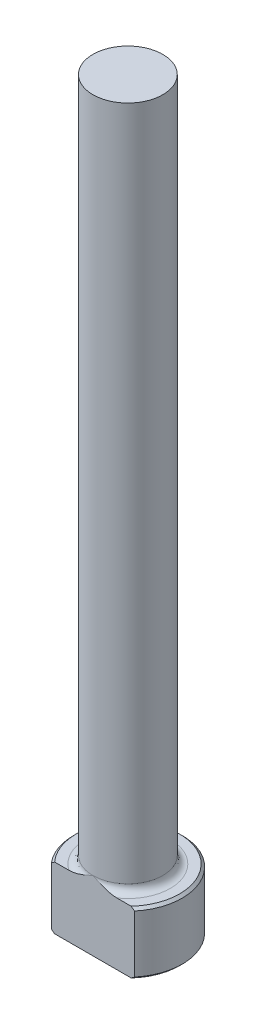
ISO-10303-21;
HEADER;
FILE_DESCRIPTION(('STEP AP214'),'2;1');
FILE_NAME('part.step','',(''),(''),'','','');
FILE_SCHEMA(('AUTOMOTIVE_DESIGN { 1 0 10303 214 1 1 1 1 }'));
ENDSEC;
DATA;
#1=APPLICATION_CONTEXT('core data for automotive mechanical design processes');
#2=APPLICATION_PROTOCOL_DEFINITION('international standard','automotive_design',2000,#1);
#3=PRODUCT_CONTEXT('',#1,'mechanical');
#4=PRODUCT('Part','Part','',(#3));
#5=PRODUCT_RELATED_PRODUCT_CATEGORY('part','',(#4));
#6=PRODUCT_DEFINITION_FORMATION('','',#4);
#7=PRODUCT_DEFINITION_CONTEXT('part definition',#1,'design');
#8=PRODUCT_DEFINITION('design','',#6,#7);
#9=PRODUCT_DEFINITION_SHAPE('','',#8);
#10=(LENGTH_UNIT() NAMED_UNIT(*) SI_UNIT(.MILLI.,.METRE.));
#11=(NAMED_UNIT(*) PLANE_ANGLE_UNIT() SI_UNIT($,.RADIAN.));
#12=(NAMED_UNIT(*) SI_UNIT($,.STERADIAN.) SOLID_ANGLE_UNIT());
#13=UNCERTAINTY_MEASURE_WITH_UNIT(LENGTH_MEASURE(1.E-05),#10,'distance_accuracy_value','');
#14=(GEOMETRIC_REPRESENTATION_CONTEXT(3) GLOBAL_UNCERTAINTY_ASSIGNED_CONTEXT((#13)) GLOBAL_UNIT_ASSIGNED_CONTEXT((#10,
#11,#12)) REPRESENTATION_CONTEXT('',''));
#15=CARTESIAN_POINT('',(0.,0.,0.));
#16=DIRECTION('',(0.,0.,1.));
#17=DIRECTION('',(1.,0.,0.));
#18=AXIS2_PLACEMENT_3D('',#15,#16,#17);
#19=CARTESIAN_POINT('',(0.,0.,0.));
#20=DIRECTION('',(0.,-1.,0.));
#21=DIRECTION('',(0.,0.,-1.));
#22=AXIS2_PLACEMENT_3D('',#19,#20,#21);
#23=PLANE('',#22);
#24=CARTESIAN_POINT('',(0.,0.,0.));
#25=DIRECTION('',(0.,-1.,0.));
#26=DIRECTION('',(0.,0.,-1.));
#27=AXIS2_PLACEMENT_3D('',#24,#25,#26);
#28=CIRCLE('',#27,5.29589999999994);
#29=CARTESIAN_POINT('',(-3.91060119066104,0.,3.57123999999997));
#30=VERTEX_POINT('',#29);
#31=CARTESIAN_POINT('',(3.91060119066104,0.,3.57123999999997));
#32=VERTEX_POINT('',#31);
#33=EDGE_CURVE('E98',#30,#32,#28,.T.);
#34=ORIENTED_EDGE('',*,*,#33,.T.);
#35=DIRECTION('',(-1.,0.,0.));
#36=VECTOR('',#35,1.);
#37=CARTESIAN_POINT('',(-4.24825080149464,0.,3.57123999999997));
#38=LINE('',#37,#36);
#39=EDGE_CURVE('E83',#32,#30,#38,.T.);
#40=ORIENTED_EDGE('',*,*,#39,.T.);
#41=EDGE_LOOP('',(#34,#40));
#42=FACE_BOUND('',#41,.T.);
#43=ADVANCED_FACE('F32',(#42),#23,.T.);
#44=CARTESIAN_POINT('',(0.,259.958771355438,0.));
#45=DIRECTION('',(0.,1.,0.));
#46=DIRECTION('',(0.,0.,1.));
#47=AXIS2_PLACEMENT_3D('',#44,#45,#46);
#48=CYLINDRICAL_SURFACE('',#47,5.54989999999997);
#49=CARTESIAN_POINT('',(0.,6.09599999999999,0.));
#50=DIRECTION('',(0.,1.,0.));
#51=DIRECTION('',(0.,0.,1.));
#52=AXIS2_PLACEMENT_3D('',#49,#50,#51);
#53=CIRCLE('',#52,5.54989999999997);
#54=CARTESIAN_POINT('',(-4.24825080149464,6.09599999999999,3.57123999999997));
#55=VERTEX_POINT('',#54);
#56=CARTESIAN_POINT('',(4.24825080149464,6.09599999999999,3.57123999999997));
#57=VERTEX_POINT('',#56);
#58=EDGE_CURVE('E104',#55,#57,#53,.F.);
#59=ORIENTED_EDGE('',*,*,#58,.T.);
#60=DIRECTION('',(0.,-1.,0.));
#61=VECTOR('',#60,1.);
#62=CARTESIAN_POINT('',(4.24825080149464,76.2,3.57123999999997));
#63=LINE('',#62,#61);
#64=CARTESIAN_POINT('',(4.24825080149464,0.254000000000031,3.57123999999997));
#65=VERTEX_POINT('',#64);
#66=EDGE_CURVE('E183',#57,#65,#63,.T.);
#67=ORIENTED_EDGE('',*,*,#66,.T.);
#68=CARTESIAN_POINT('',(0.,0.254000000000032,0.));
#69=DIRECTION('',(0.,-1.,0.));
#70=DIRECTION('',(0.,0.,-1.));
#71=AXIS2_PLACEMENT_3D('',#68,#69,#70);
#72=CIRCLE('',#71,5.54989999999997);
#73=CARTESIAN_POINT('',(-4.24825080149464,0.254000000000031,3.57123999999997));
#74=VERTEX_POINT('',#73);
#75=EDGE_CURVE('E100',#65,#74,#72,.F.);
#76=ORIENTED_EDGE('',*,*,#75,.T.);
#77=DIRECTION('',(0.,-1.,0.));
#78=VECTOR('',#77,1.);
#79=CARTESIAN_POINT('',(-4.24825080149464,76.2,3.57123999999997));
#80=LINE('',#79,#78);
#81=EDGE_CURVE('E93',#55,#74,#80,.T.);
#82=ORIENTED_EDGE('',*,*,#81,.F.);
#83=EDGE_LOOP('',(#59,#67,#76,#82));
#84=FACE_BOUND('',#83,.T.);
#85=ADVANCED_FACE('F158',(#84),#48,.T.);
#86=CARTESIAN_POINT('',(-5.54989999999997,6.35,0.));
#87=DIRECTION('',(0.,1.,0.));
#88=DIRECTION('',(0.,0.,1.));
#89=AXIS2_PLACEMENT_3D('',#86,#87,#88);
#90=PLANE('',#89);
#91=CARTESIAN_POINT('',(0.,6.35,0.));
#92=DIRECTION('',(0.,1.,0.));
#93=DIRECTION('',(0.,0.,1.));
#94=AXIS2_PLACEMENT_3D('',#91,#92,#93);
#95=CIRCLE('',#94,5.2959);
#96=CARTESIAN_POINT('',(3.91060119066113,6.35,3.57123999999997));
#97=VERTEX_POINT('',#96);
#98=CARTESIAN_POINT('',(-3.91060119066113,6.35,3.57123999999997));
#99=VERTEX_POINT('',#98);
#100=EDGE_CURVE('E178',#97,#99,#95,.T.);
#101=ORIENTED_EDGE('',*,*,#100,.T.);
#102=DIRECTION('',(1.,0.,0.));
#103=VECTOR('',#102,1.);
#104=CARTESIAN_POINT('',(-5.54989999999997,6.35,3.57123999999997));
#105=LINE('',#104,#103);
#106=CARTESIAN_POINT('',(-2.4542236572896,6.35000000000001,3.57123999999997));
#107=VERTEX_POINT('',#106);
#108=EDGE_CURVE('E57',#99,#107,#105,.T.);
#109=ORIENTED_EDGE('',*,*,#108,.T.);
#110=CARTESIAN_POINT('',(0.,6.35,0.));
#111=DIRECTION('',(0.,1.,0.));
#112=DIRECTION('',(0.,0.,1.));
#113=AXIS2_PLACEMENT_3D('',#110,#111,#112);
#114=CIRCLE('',#113,4.33323999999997);
#115=CARTESIAN_POINT('',(2.45422365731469,6.35000000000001,3.57123999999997));
#116=VERTEX_POINT('',#115);
#117=EDGE_CURVE('E107',#107,#116,#114,.F.);
#118=ORIENTED_EDGE('',*,*,#117,.T.);
#119=EDGE_CURVE('E136',#116,#97,#105,.T.);
#120=ORIENTED_EDGE('',*,*,#119,.T.);
#121=EDGE_LOOP('',(#101,#109,#118,#120));
#122=FACE_BOUND('',#121,.T.);
#123=ADVANCED_FACE('F147',(#122),#90,.T.);
#124=CARTESIAN_POINT('',(0.,6.35000000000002,0.));
#125=DIRECTION('',(0.,-1.,0.));
#126=DIRECTION('',(0.,0.,-1.));
#127=AXIS2_PLACEMENT_3D('',#124,#125,#126);
#128=CONICAL_SURFACE('',#127,5.29589999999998,0.785398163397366);
#129=ORIENTED_EDGE('',*,*,#58,.F.);
#130=CARTESIAN_POINT('',(-9.34862922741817,1.63837165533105,3.57123999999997));
#131=CARTESIAN_POINT('',(-9.20449095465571,1.7730174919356,3.57123999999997));
#132=CARTESIAN_POINT('',(-9.06015748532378,1.90745428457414,3.57123999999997));
#133=CARTESIAN_POINT('',(-8.77103871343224,2.17584295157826,3.57123999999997));
#134=CARTESIAN_POINT('',(-8.62625340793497,2.30979482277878,3.57123999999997));
#135=CARTESIAN_POINT('',(-8.19106245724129,2.71088279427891,3.57123999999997));
#136=CARTESIAN_POINT('',(-7.89988923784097,2.97718811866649,3.57123999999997));
#137=CARTESIAN_POINT('',(-7.31266273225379,3.50875703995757,3.57123999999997));
#138=CARTESIAN_POINT('',(-7.0165892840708,3.77399839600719,3.57123999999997));
#139=CARTESIAN_POINT('',(-6.42070514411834,4.30018345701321,3.57123999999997));
#140=CARTESIAN_POINT('',(-6.12089498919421,4.56112776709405,3.57123999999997));
#141=CARTESIAN_POINT('',(-5.57379517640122,5.02739327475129,3.57123999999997));
#142=CARTESIAN_POINT('',(-5.32743465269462,5.23380250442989,3.57123999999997));
#143=CARTESIAN_POINT('',(-4.82983105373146,5.64086952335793,3.57123999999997));
#144=CARTESIAN_POINT('',(-4.57858641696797,5.84152542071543,3.57123999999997));
#145=CARTESIAN_POINT('',(-4.19689664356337,6.13579820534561,3.57123999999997));
#146=CARTESIAN_POINT('',(-4.06897719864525,6.23268859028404,3.57123999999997));
#147=CARTESIAN_POINT('',(-3.81112388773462,6.42374523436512,3.57123999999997));
#148=CARTESIAN_POINT('',(-3.68119013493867,6.5179116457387,3.57123999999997));
#149=CARTESIAN_POINT('',(-3.41897062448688,6.70277603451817,3.57123999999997));
#150=CARTESIAN_POINT('',(-3.28668612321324,6.79347578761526,3.57123999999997));
#151=CARTESIAN_POINT('',(-3.0192275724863,6.97049297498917,3.57123999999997));
#152=CARTESIAN_POINT('',(-2.88405397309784,7.05681108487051,3.57123999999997));
#153=CARTESIAN_POINT('',(-2.62920774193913,7.21219297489,3.57123999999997));
#154=CARTESIAN_POINT('',(-2.5099840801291,7.28198981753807,3.57123999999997));
#155=CARTESIAN_POINT('',(-2.26853125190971,7.41625275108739,3.57123999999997));
#156=CARTESIAN_POINT('',(-2.14630175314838,7.48071824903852,3.57123999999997));
#157=CARTESIAN_POINT('',(-1.8985261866,7.60281435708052,3.57123999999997));
#158=CARTESIAN_POINT('',(-1.77298191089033,7.6604485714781,3.57123999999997));
#159=CARTESIAN_POINT('',(-1.51824567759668,7.76705237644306,3.57123999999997));
#160=CARTESIAN_POINT('',(-1.38905465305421,7.8160241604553,3.57123999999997));
#161=CARTESIAN_POINT('',(-1.1539073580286,7.89415135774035,3.57123999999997));
#162=CARTESIAN_POINT('',(-1.04862109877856,7.92531105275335,3.57123999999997));
#163=CARTESIAN_POINT('',(-0.835998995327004,7.97955362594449,3.57123999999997));
#164=CARTESIAN_POINT('',(-0.728663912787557,8.00263944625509,3.57123999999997));
#165=CARTESIAN_POINT('',(-0.512745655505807,8.0396006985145,3.57123999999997));
#166=CARTESIAN_POINT('',(-0.404167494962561,8.05350499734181,3.57123999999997));
#167=CARTESIAN_POINT('',(-0.186191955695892,8.071458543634,3.57123999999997));
#168=CARTESIAN_POINT('',(-0.0767946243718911,8.0755083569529,3.57123999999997));
#169=CARTESIAN_POINT('',(0.142206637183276,8.07351212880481,3.57123999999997));
#170=CARTESIAN_POINT('',(0.251810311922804,8.0674383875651,3.57123999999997));
#171=CARTESIAN_POINT('',(0.470024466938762,8.04549916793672,3.57123999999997));
#172=CARTESIAN_POINT('',(0.578634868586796,8.02963292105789,3.57123999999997));
#173=CARTESIAN_POINT('',(0.794483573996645,7.98889583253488,3.57123999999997));
#174=CARTESIAN_POINT('',(0.901716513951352,7.96399693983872,3.57123999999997));
#175=CARTESIAN_POINT('',(1.11401362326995,7.90633497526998,3.57123999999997));
#176=CARTESIAN_POINT('',(1.21907768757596,7.87357152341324,3.57123999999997));
#177=CARTESIAN_POINT('',(1.55442535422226,7.75709852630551,3.57123999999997));
#178=CARTESIAN_POINT('',(1.78015988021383,7.66020810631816,3.57123999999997));
#179=CARTESIAN_POINT('',(2.11063839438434,7.49869222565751,3.57123999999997));
#180=CARTESIAN_POINT('',(2.21956521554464,7.4420820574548,3.57123999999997));
#181=CARTESIAN_POINT('',(2.43502073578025,7.32445015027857,3.57123999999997));
#182=CARTESIAN_POINT('',(2.54154973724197,7.26342897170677,3.57123999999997));
#183=CARTESIAN_POINT('',(2.75384117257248,7.13701656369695,3.57123999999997));
#184=CARTESIAN_POINT('',(2.85957563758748,7.07157883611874,3.57123999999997));
#185=CARTESIAN_POINT('',(3.06914141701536,6.93772653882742,3.57123999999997));
#186=CARTESIAN_POINT('',(3.17297268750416,6.86931190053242,3.57123999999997));
#187=CARTESIAN_POINT('',(3.48178799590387,6.66057078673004,3.57123999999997));
#188=CARTESIAN_POINT('',(3.68431418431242,6.51661264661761,3.57123999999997));
#189=CARTESIAN_POINT('',(4.13501059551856,6.18482897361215,3.57123999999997));
#190=CARTESIAN_POINT('',(4.3817757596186,5.99511425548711,3.57123999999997));
#191=CARTESIAN_POINT('',(4.86985386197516,5.60875730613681,3.57123999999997));
#192=CARTESIAN_POINT('',(5.11116579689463,5.4121138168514,3.57123999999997));
#193=CARTESIAN_POINT('',(5.59003172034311,5.01381470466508,3.57123999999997));
#194=CARTESIAN_POINT('',(5.82758147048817,4.81215400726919,3.57123999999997));
#195=CARTESIAN_POINT('',(6.29968686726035,4.40535532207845,3.57123999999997));
#196=CARTESIAN_POINT('',(6.53424243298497,4.20021724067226,3.57123999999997));
#197=CARTESIAN_POINT('',(6.98601923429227,3.80065590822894,3.57123999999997));
#198=CARTESIAN_POINT('',(7.20338349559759,3.60639403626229,3.57123999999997));
#199=CARTESIAN_POINT('',(7.63652694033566,3.21610232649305,3.57123999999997));
#200=CARTESIAN_POINT('',(7.85230608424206,3.02007244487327,3.57123999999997));
#201=CARTESIAN_POINT('',(8.28210401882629,2.62706235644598,3.57123999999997));
#202=CARTESIAN_POINT('',(8.49612567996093,2.43008528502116,3.57123999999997));
#203=CARTESIAN_POINT('',(8.92311188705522,2.03500873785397,3.57123999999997));
#204=CARTESIAN_POINT('',(9.13607648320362,1.83690931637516,3.57123999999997));
#205=CARTESIAN_POINT('',(9.34862922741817,1.63837165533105,3.57123999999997));
#206=B_SPLINE_CURVE_WITH_KNOTS('',3,(#130,#131,#132,#133,#134,#135,#136,#137,#138,#139,#140,
#141,#142,#143,#144,#145,#146,#147,#148,#149,#150,#151,#152,#153,#154,#155,#156,#157,#158,#159,
#160,#161,#162,#163,#164,#165,#166,#167,#168,#169,#170,#171,#172,#173,#174,#175,#176,#177,#178,
#179,#180,#181,#182,#183,#184,#185,#186,#187,#188,#189,#190,#191,#192,#193,#194,#195,#196,#197,
#198,#199,#200,#201,#202,#203,#204,#205),.UNSPECIFIED.,.F.,.F.,(4,2,2,2,2,2,2,2,2,2,2,2,2,2,2,2,
2,2,2,2,2,2,2,2,2,2,2,2,2,2,2,2,2,2,2,2,2,4),(0.,0.591732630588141,1.18346911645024,
2.36721926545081,3.55971708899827,4.75204551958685,5.71619439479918,6.68065676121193,
7.16204440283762,7.64340508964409,8.1245158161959,8.60555213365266,9.01990095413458,
9.43429579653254,9.84847101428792,10.2625412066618,10.591672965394,10.920684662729,
11.2486569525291,11.5766104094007,11.9054626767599,12.2343407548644,12.5642490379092,
12.8941732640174,13.6289554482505,13.9971988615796,14.3653955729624,14.7383788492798,
15.1113707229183,15.856580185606,16.7901898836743,17.7239699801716,18.6587363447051,
19.5935279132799,20.4680812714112,21.3426563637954,22.2152613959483,23.0878245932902),.UNSPECIFIED.);
#207=EDGE_CURVE('E135',#55,#99,#206,.T.);
#208=ORIENTED_EDGE('',*,*,#207,.T.);
#209=ORIENTED_EDGE('',*,*,#100,.F.);
#210=EDGE_CURVE('E127',#97,#57,#206,.T.);
#211=ORIENTED_EDGE('',*,*,#210,.T.);
#212=EDGE_LOOP('',(#129,#208,#209,#211));
#213=FACE_BOUND('',#212,.T.);
#214=ADVANCED_FACE('F143',(#213),#128,.T.);
#215=CARTESIAN_POINT('',(0.,0.254000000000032,0.));
#216=DIRECTION('',(0.,1.,0.));
#217=DIRECTION('',(0.,0.,1.));
#218=AXIS2_PLACEMENT_3D('',#215,#216,#217);
#219=CONICAL_SURFACE('',#218,5.54989999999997,0.785398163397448);
#220=ORIENTED_EDGE('',*,*,#75,.F.);
#221=CARTESIAN_POINT('',(9.34862922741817,4.71162834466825,3.57123999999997));
#222=CARTESIAN_POINT('',(9.2044909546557,4.5769825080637,3.57123999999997));
#223=CARTESIAN_POINT('',(9.06015748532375,4.44254571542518,3.57123999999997));
#224=CARTESIAN_POINT('',(8.77103871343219,4.17415704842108,3.57123999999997));
#225=CARTESIAN_POINT('',(8.62625340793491,4.04020517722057,3.57123999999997));
#226=CARTESIAN_POINT('',(8.1910624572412,3.63911720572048,3.57123999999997));
#227=CARTESIAN_POINT('',(7.89988923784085,3.37281188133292,3.57123999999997));
#228=CARTESIAN_POINT('',(7.31266273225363,2.84124296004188,3.57123999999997));
#229=CARTESIAN_POINT('',(7.01658928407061,2.57600160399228,3.57123999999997));
#230=CARTESIAN_POINT('',(6.4207051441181,2.04981654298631,3.57123999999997));
#231=CARTESIAN_POINT('',(6.12089498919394,1.78887223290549,3.57123999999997));
#232=CARTESIAN_POINT('',(5.57379517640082,1.32260672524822,3.57123999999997));
#233=CARTESIAN_POINT('',(5.32743465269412,1.11619749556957,3.57123999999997));
#234=CARTESIAN_POINT('',(4.82983105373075,0.709130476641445,3.57123999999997));
#235=CARTESIAN_POINT('',(4.57858641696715,0.508474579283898,3.57123999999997));
#236=CARTESIAN_POINT('',(4.19689664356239,0.214201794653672,3.57123999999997));
#237=CARTESIAN_POINT('',(4.06897719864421,0.117311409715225,3.57123999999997));
#238=CARTESIAN_POINT('',(3.81112388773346,-0.0737452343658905,3.57123999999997));
#239=CARTESIAN_POINT('',(3.68119013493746,-0.167911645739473,3.57123999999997));
#240=CARTESIAN_POINT('',(3.41897062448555,-0.352776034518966,3.57123999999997));
#241=CARTESIAN_POINT('',(3.28668612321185,-0.44347578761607,3.57123999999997));
#242=CARTESIAN_POINT('',(3.01922757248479,-0.620492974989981,3.57123999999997));
#243=CARTESIAN_POINT('',(2.88405397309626,-0.70681108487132,3.57123999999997));
#244=CARTESIAN_POINT('',(2.62920774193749,-0.862192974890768,3.57123999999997));
#245=CARTESIAN_POINT('',(2.50998408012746,-0.931989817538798,3.57123999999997));
#246=CARTESIAN_POINT('',(2.26853125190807,-1.06625275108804,3.57123999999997));
#247=CARTESIAN_POINT('',(2.14630175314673,-1.13071824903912,3.57123999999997));
#248=CARTESIAN_POINT('',(1.89852618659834,-1.25281435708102,3.57123999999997));
#249=CARTESIAN_POINT('',(1.77298191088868,-1.31044857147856,3.57123999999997));
#250=CARTESIAN_POINT('',(1.51824567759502,-1.41705237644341,3.57123999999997));
#251=CARTESIAN_POINT('',(1.38905465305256,-1.4660241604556,3.57123999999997));
#252=CARTESIAN_POINT('',(1.15390735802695,-1.54415135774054,3.57123999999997));
#253=CARTESIAN_POINT('',(1.04862109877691,-1.5753110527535,3.57123999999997));
#254=CARTESIAN_POINT('',(0.835998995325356,-1.62955362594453,3.57123999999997));
#255=CARTESIAN_POINT('',(0.728663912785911,-1.65263944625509,3.57123999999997));
#256=CARTESIAN_POINT('',(0.512745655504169,-1.68960069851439,3.57123999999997));
#257=CARTESIAN_POINT('',(0.404167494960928,-1.70350499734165,3.57123999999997));
#258=CARTESIAN_POINT('',(0.186191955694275,-1.72145854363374,3.57123999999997));
#259=CARTESIAN_POINT('',(0.0767946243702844,-1.72550835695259,3.57123999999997));
#260=CARTESIAN_POINT('',(-0.142206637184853,-1.72351212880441,3.57123999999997));
#261=CARTESIAN_POINT('',(-0.251810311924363,-1.71743838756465,3.57123999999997));
#262=CARTESIAN_POINT('',(-0.47002446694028,-1.69549916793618,3.57123999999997));
#263=CARTESIAN_POINT('',(-0.578634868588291,-1.67963292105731,3.57123999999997));
#264=CARTESIAN_POINT('',(-0.794483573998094,-1.63889583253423,3.57123999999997));
#265=CARTESIAN_POINT('',(-0.901716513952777,-1.61399693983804,3.57123999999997));
#266=CARTESIAN_POINT('',(-1.11401362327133,-1.55633497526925,3.57123999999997));
#267=CARTESIAN_POINT('',(-1.21907768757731,-1.52357152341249,3.57123999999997));
#268=CARTESIAN_POINT('',(-1.55442535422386,-1.40709852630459,3.57123999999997));
#269=CARTESIAN_POINT('',(-1.78015988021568,-1.31020810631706,3.57123999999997));
#270=CARTESIAN_POINT('',(-2.11063839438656,-1.14869222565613,3.57123999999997));
#271=CARTESIAN_POINT('',(-2.21956521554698,-1.09208205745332,3.57123999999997));
#272=CARTESIAN_POINT('',(-2.43502073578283,-0.974450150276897,3.57123999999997));
#273=CARTESIAN_POINT('',(-2.54154973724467,-0.913428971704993,3.57123999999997));
#274=CARTESIAN_POINT('',(-2.75384117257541,-0.787016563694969,3.57123999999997));
#275=CARTESIAN_POINT('',(-2.85957563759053,-0.721578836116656,3.57123999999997));
#276=CARTESIAN_POINT('',(-3.06914141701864,-0.58772653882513,3.57123999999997));
#277=CARTESIAN_POINT('',(-3.17297268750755,-0.519311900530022,3.57123999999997));
#278=CARTESIAN_POINT('',(-3.4817879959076,-0.310570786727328,3.57123999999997));
#279=CARTESIAN_POINT('',(-3.68431418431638,-0.166612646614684,3.57123999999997));
#280=CARTESIAN_POINT('',(-4.13501059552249,0.165171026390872,3.57123999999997));
#281=CARTESIAN_POINT('',(-4.3817757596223,0.354885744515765,3.57123999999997));
#282=CARTESIAN_POINT('',(-4.86985386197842,0.741242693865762,3.57123999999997));
#283=CARTESIAN_POINT('',(-5.11116579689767,0.937886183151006,3.57123999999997));
#284=CARTESIAN_POINT('',(-5.59003172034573,1.33618529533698,3.57123999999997));
#285=CARTESIAN_POINT('',(-5.82758147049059,1.53784599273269,3.57123999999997));
#286=CARTESIAN_POINT('',(-6.29968686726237,1.94464467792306,3.57123999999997));
#287=CARTESIAN_POINT('',(-6.53424243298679,2.14978275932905,3.57123999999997));
#288=CARTESIAN_POINT('',(-6.98601923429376,2.54934409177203,3.57123999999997));
#289=CARTESIAN_POINT('',(-7.20338349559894,2.74360596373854,3.57123999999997));
#290=CARTESIAN_POINT('',(-7.63652694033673,3.13389767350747,3.57123999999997));
#291=CARTESIAN_POINT('',(-7.852306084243,3.3299275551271,3.57123999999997));
#292=CARTESIAN_POINT('',(-8.28210401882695,3.72293764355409,3.57123999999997));
#293=CARTESIAN_POINT('',(-8.49612567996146,3.91991471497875,3.57123999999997));
#294=CARTESIAN_POINT('',(-8.92311188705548,4.31499126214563,3.57123999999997));
#295=CARTESIAN_POINT('',(-9.13607648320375,4.51309068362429,3.57123999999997));
#296=CARTESIAN_POINT('',(-9.34862922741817,4.71162834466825,3.57123999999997));
#297=B_SPLINE_CURVE_WITH_KNOTS('',3,(#221,#222,#223,#224,#225,#226,#227,#228,#229,#230,#231,
#232,#233,#234,#235,#236,#237,#238,#239,#240,#241,#242,#243,#244,#245,#246,#247,#248,#249,#250,
#251,#252,#253,#254,#255,#256,#257,#258,#259,#260,#261,#262,#263,#264,#265,#266,#267,#268,#269,
#270,#271,#272,#273,#274,#275,#276,#277,#278,#279,#280,#281,#282,#283,#284,#285,#286,#287,#288,
#289,#290,#291,#292,#293,#294,#295,#296),.UNSPECIFIED.,.F.,.F.,(4,2,2,2,2,2,2,2,2,2,2,2,2,2,2,2,
2,2,2,2,2,2,2,2,2,2,2,2,2,2,2,2,2,2,2,2,2,4),(0.,0.59173263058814,1.18346911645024,
2.36721926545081,3.55971708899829,4.75204551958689,5.71619439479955,6.68065676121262,
7.16204440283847,7.64340508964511,8.12451581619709,8.605552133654,9.01990095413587,
9.43429579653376,9.84847101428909,10.2625412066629,10.5916729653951,10.92068466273,
11.2486569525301,11.5766104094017,11.9054626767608,12.2343407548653,12.56424903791,
12.8941732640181,13.6289554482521,13.9971988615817,14.3653955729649,14.7383788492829,
15.1113707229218,15.8565801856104,16.7901898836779,17.7239699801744,18.6587363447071,
19.593527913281,20.4680812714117,21.3426563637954,22.2152613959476,23.0878245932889),.UNSPECIFIED.);
#298=EDGE_CURVE('E86',#65,#32,#297,.T.);
#299=ORIENTED_EDGE('',*,*,#298,.T.);
#300=ORIENTED_EDGE('',*,*,#33,.F.);
#301=EDGE_CURVE('E89',#30,#74,#297,.T.);
#302=ORIENTED_EDGE('',*,*,#301,.T.);
#303=EDGE_LOOP('',(#220,#299,#300,#302));
#304=FACE_BOUND('',#303,.T.);
#305=ADVANCED_FACE('F97',(#304),#219,.T.);
#306=CARTESIAN_POINT('',(0.,7.11200000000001,0.));
#307=DIRECTION('',(0.,1.,0.));
#308=DIRECTION('',(0.,0.,1.));
#309=AXIS2_PLACEMENT_3D('',#306,#307,#308);
#310=TOROIDAL_SURFACE('',#309,4.33323999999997,0.762);
#311=CARTESIAN_POINT('',(0.,7.11200000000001,3.57123999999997));
#312=CARTESIAN_POINT('',(-5.01521697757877E-13,7.11200100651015,3.57123999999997));
#313=CARTESIAN_POINT('',(1.76590739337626E-07,7.11200201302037,3.57123999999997));
#314=CARTESIAN_POINT('',(7.55286765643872E-07,7.11200396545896,3.57123999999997));
#315=CARTESIAN_POINT('',(1.16131545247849E-06,7.11200491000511,3.57123999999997));
#316=CARTESIAN_POINT('',(2.14347150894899E-06,7.1120067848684,3.57123999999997));
#317=CARTESIAN_POINT('',(2.72908456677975E-06,7.1120077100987,3.57123999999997));
#318=CARTESIAN_POINT('',(4.00559807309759E-06,7.11200947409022,3.57123999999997));
#319=CARTESIAN_POINT('',(4.69593042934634E-06,7.11201031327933,3.57123999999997));
#320=CARTESIAN_POINT('',(7.12798779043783E-06,7.1120130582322,3.57123999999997));
#321=CARTESIAN_POINT('',(9.00885578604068E-06,7.11201484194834,3.57123999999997));
#322=CARTESIAN_POINT('',(1.29410398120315E-05,7.11201807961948,3.57123999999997));
#323=CARTESIAN_POINT('',(1.49866128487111E-05,7.11201954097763,3.57123999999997));
#324=CARTESIAN_POINT('',(2.27853159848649E-05,7.11202486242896,3.57123999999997));
#325=CARTESIAN_POINT('',(2.87443387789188E-05,7.11202843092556,3.57123999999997));
#326=CARTESIAN_POINT('',(4.06410352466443E-05,7.11203442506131,3.57123999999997));
#327=CARTESIAN_POINT('',(4.65470368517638E-05,7.11203691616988,3.57123999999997));
#328=CARTESIAN_POINT('',(7.11711037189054E-05,7.11204719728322,3.57123999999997));
#329=CARTESIAN_POINT('',(8.99605831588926E-05,7.11205478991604,3.57123999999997));
#330=CARTESIAN_POINT('',(0.00012545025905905,7.11206727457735,3.57123999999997));
#331=CARTESIAN_POINT('',(0.000142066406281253,7.1120723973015,3.57123999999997));
#332=CARTESIAN_POINT('',(0.000260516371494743,7.11211213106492,3.57123999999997));
#333=CARTESIAN_POINT('',(0.00035660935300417,7.1121616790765,3.57123999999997));
#334=CARTESIAN_POINT('',(0.000727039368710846,7.1123455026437,3.57123999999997));
#335=CARTESIAN_POINT('',(0.001005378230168,7.11246868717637,3.57123999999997));
#336=CARTESIAN_POINT('',(0.00207465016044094,7.11294918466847,3.57123999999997));
#337=CARTESIAN_POINT('',(0.00286145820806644,7.11331811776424,3.57123999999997));
#338=CARTESIAN_POINT('',(0.00604597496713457,7.11480388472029,3.57123999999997));
#339=CARTESIAN_POINT('',(0.00844825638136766,7.11590763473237,3.57123999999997));
#340=CARTESIAN_POINT('',(0.0421206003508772,7.13138817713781,3.57123999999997));
#341=CARTESIAN_POINT('',(0.0733565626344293,7.1458632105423,3.57123999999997));
#342=CARTESIAN_POINT('',(0.136296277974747,7.1749208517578,3.57123999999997));
#343=CARTESIAN_POINT('',(0.168000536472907,7.18950218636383,3.57123999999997));
#344=CARTESIAN_POINT('',(0.26049771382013,7.23192483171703,3.57123999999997));
#345=CARTESIAN_POINT('',(0.321333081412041,7.2596772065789,3.57123999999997));
#346=CARTESIAN_POINT('',(0.450063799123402,7.3176989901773,3.57123999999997));
#347=CARTESIAN_POINT('',(0.517988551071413,7.34790319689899,3.57123999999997));
#348=CARTESIAN_POINT('',(0.654961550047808,7.40755967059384,3.57123999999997));
#349=CARTESIAN_POINT('',(0.724014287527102,7.4370016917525,3.57123999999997));
#350=CARTESIAN_POINT('',(0.845579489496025,7.48730903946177,3.57123999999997));
#351=CARTESIAN_POINT('',(0.897958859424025,7.5084946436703,3.57123999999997));
#352=CARTESIAN_POINT('',(1.00299625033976,7.54979079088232,3.57123999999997));
#353=CARTESIAN_POINT('',(1.05565332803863,7.56990374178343,3.57123999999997));
#354=CARTESIAN_POINT('',(1.21212759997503,7.62761302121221,3.57123999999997));
#355=CARTESIAN_POINT('',(1.31659809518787,7.66348622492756,3.57123999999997));
#356=CARTESIAN_POINT('',(1.49278330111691,7.71807663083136,3.57123999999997));
#357=CARTESIAN_POINT('',(1.56395183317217,7.73855254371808,3.57123999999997));
#358=CARTESIAN_POINT('',(1.70759150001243,7.77611793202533,3.57123999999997));
#359=CARTESIAN_POINT('',(1.78006754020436,7.79318887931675,3.57123999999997));
#360=CARTESIAN_POINT('',(1.9296081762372,7.82384868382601,3.57123999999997));
#361=CARTESIAN_POINT('',(2.00671897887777,7.83721686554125,3.57123999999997));
#362=CARTESIAN_POINT('',(2.16170557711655,7.85827154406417,3.57123999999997));
#363=CARTESIAN_POINT('',(2.23958110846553,7.86595993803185,3.57123999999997));
#364=CARTESIAN_POINT('',(2.41316458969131,7.87541912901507,3.57123999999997));
#365=CARTESIAN_POINT('',(2.50897971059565,7.87548974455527,3.57123999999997));
#366=CARTESIAN_POINT('',(2.69873879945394,7.86266617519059,3.57123999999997));
#367=CARTESIAN_POINT('',(2.79269122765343,7.84993298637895,3.57123999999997));
#368=CARTESIAN_POINT('',(2.94834629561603,7.81478970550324,3.57123999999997));
#369=CARTESIAN_POINT('',(3.01099313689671,7.79661956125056,3.57123999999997));
#370=CARTESIAN_POINT('',(3.13311783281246,7.75119466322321,3.57123999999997));
#371=CARTESIAN_POINT('',(3.19259303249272,7.72393243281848,3.57123999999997));
#372=CARTESIAN_POINT('',(3.2895229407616,7.66822810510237,3.57123999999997));
#373=CARTESIAN_POINT('',(3.32843006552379,7.64232613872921,3.57123999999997));
#374=CARTESIAN_POINT('',(3.40175541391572,7.58480019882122,3.57123999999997));
#375=CARTESIAN_POINT('',(3.43618193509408,7.55318706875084,3.57123999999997));
#376=CARTESIAN_POINT('',(3.49199473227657,7.49158316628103,3.57123999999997));
#377=CARTESIAN_POINT('',(3.5145944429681,7.4626970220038,3.57123999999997));
#378=CARTESIAN_POINT('',(3.55479974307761,7.40160169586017,3.57123999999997));
#379=CARTESIAN_POINT('',(3.57240720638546,7.36939376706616,3.57123999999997));
#380=CARTESIAN_POINT('',(3.60162953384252,7.30200115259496,3.57123999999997));
#381=CARTESIAN_POINT('',(3.61319239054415,7.26679356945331,3.57123999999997));
#382=CARTESIAN_POINT('',(3.62914546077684,7.19478844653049,3.57123999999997));
#383=CARTESIAN_POINT('',(3.63354215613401,7.15799237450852,3.57123999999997));
#384=CARTESIAN_POINT('',(3.6347021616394,7.08938239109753,3.57123999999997));
#385=CARTESIAN_POINT('',(3.63243477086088,7.05758138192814,3.57123999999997));
#386=CARTESIAN_POINT('',(3.62246065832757,6.99485289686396,3.57123999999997));
#387=CARTESIAN_POINT('',(3.614754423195,6.96392534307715,3.57123999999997));
#388=CARTESIAN_POINT('',(3.59460534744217,6.90439360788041,3.57123999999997));
#389=CARTESIAN_POINT('',(3.5822644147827,6.87575447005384,3.57123999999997));
#390=CARTESIAN_POINT('',(3.55348648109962,6.82063145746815,3.57123999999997));
#391=CARTESIAN_POINT('',(3.53704806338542,6.79414833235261,3.57123999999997));
#392=CARTESIAN_POINT('',(3.49338312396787,6.73337952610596,3.57123999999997));
#393=CARTESIAN_POINT('',(3.4644863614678,6.70029184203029,3.57123999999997));
#394=CARTESIAN_POINT('',(3.40170527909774,6.63922321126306,3.57123999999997));
#395=CARTESIAN_POINT('',(3.3678091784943,6.61125468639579,3.57123999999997));
#396=CARTESIAN_POINT('',(3.28195465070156,6.54991490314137,3.57123999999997));
#397=CARTESIAN_POINT('',(3.22826146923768,6.51898089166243,3.57123999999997));
#398=CARTESIAN_POINT('',(3.11685649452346,6.4659881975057,3.57123999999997));
#399=CARTESIAN_POINT('',(3.05914651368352,6.44392554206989,3.57123999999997));
#400=CARTESIAN_POINT('',(2.90895675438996,6.397325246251,3.57123999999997));
#401=CARTESIAN_POINT('',(2.81483745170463,6.37812048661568,3.57123999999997));
#402=CARTESIAN_POINT('',(2.62379203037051,6.35393265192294,3.57123999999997));
#403=CARTESIAN_POINT('',(2.52684524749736,6.34914127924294,3.57123999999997));
#404=CARTESIAN_POINT('',(2.34175764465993,6.35101691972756,3.57123999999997));
#405=CARTESIAN_POINT('',(2.25359864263,6.35670506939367,3.57123999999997));
#406=CARTESIAN_POINT('',(2.07796266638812,6.37582328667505,3.57123999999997));
#407=CARTESIAN_POINT('',(1.99048774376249,6.38927124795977,3.57123999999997));
#408=CARTESIAN_POINT('',(1.82119356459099,6.42156125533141,3.57123999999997));
#409=CARTESIAN_POINT('',(1.73931346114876,6.4400930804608,3.57123999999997));
#410=CARTESIAN_POINT('',(1.57721134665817,6.48159818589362,3.57123999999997));
#411=CARTESIAN_POINT('',(1.4969824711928,6.50454506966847,3.57123999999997));
#412=CARTESIAN_POINT('',(1.31237017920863,6.56193110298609,3.57123999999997));
#413=CARTESIAN_POINT('',(1.20840446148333,6.59770595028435,3.57123999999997));
#414=CARTESIAN_POINT('',(1.05265881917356,6.6552295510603,3.57123999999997));
#415=CARTESIAN_POINT('',(1.00023402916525,6.67527678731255,3.57123999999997));
#416=CARTESIAN_POINT('',(0.895657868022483,6.71642939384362,3.57123999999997));
#417=CARTESIAN_POINT('',(0.843507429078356,6.7375371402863,3.57123999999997));
#418=CARTESIAN_POINT('',(0.7223348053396,6.78770883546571,3.57123999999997));
#419=CARTESIAN_POINT('',(0.653445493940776,6.81709241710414,3.57123999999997));
#420=CARTESIAN_POINT('',(0.516794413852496,6.87662522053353,3.57123999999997));
#421=CARTESIAN_POINT('',(0.449028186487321,6.90676427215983,3.57123999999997));
#422=CARTESIAN_POINT('',(0.320599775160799,6.96465641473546,3.57123999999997));
#423=CARTESIAN_POINT('',(0.25990837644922,6.99234472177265,3.57123999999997));
#424=CARTESIAN_POINT('',(0.167629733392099,7.03466840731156,3.57123999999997));
#425=CARTESIAN_POINT('',(0.136000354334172,7.04921552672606,3.57123999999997));
#426=CARTESIAN_POINT('',(0.0732091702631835,7.07820481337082,3.57123999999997));
#427=CARTESIAN_POINT('',(0.0420468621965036,7.09264571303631,3.57123999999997));
#428=CARTESIAN_POINT('',(0.00844824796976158,7.10809236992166,3.57123999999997));
#429=CARTESIAN_POINT('',(0.00604595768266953,7.10919612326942,3.57123999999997));
#430=CARTESIAN_POINT('',(0.00286143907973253,7.11068189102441,3.57123999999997));
#431=CARTESIAN_POINT('',(0.00207463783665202,7.11105082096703,3.57123999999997));
#432=CARTESIAN_POINT('',(0.00100537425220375,7.11153131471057,3.57123999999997));
#433=CARTESIAN_POINT('',(0.000727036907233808,7.11165449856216,3.57123999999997));
#434=CARTESIAN_POINT('',(0.000356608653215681,7.11183832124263,3.57123999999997));
#435=CARTESIAN_POINT('',(0.000260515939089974,7.11188786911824,3.57123999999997));
#436=CARTESIAN_POINT('',(0.000142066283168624,7.1119276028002,3.57123999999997));
#437=CARTESIAN_POINT('',(0.000125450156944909,7.1119327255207,3.57123999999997));
#438=CARTESIAN_POINT('',(8.99605261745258E-05,7.1119452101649,3.57123999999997));
#439=CARTESIAN_POINT('',(7.11710702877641E-05,7.11195280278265,3.57123999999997));
#440=CARTESIAN_POINT('',(4.65470297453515E-05,7.11196308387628,3.57123999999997));
#441=CARTESIAN_POINT('',(4.06410314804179E-05,7.11196557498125,3.57123999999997));
#442=CARTESIAN_POINT('',(2.87443410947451E-05,7.11197156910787,3.57123999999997));
#443=CARTESIAN_POINT('',(2.27853209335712E-05,7.11197513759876,3.57123999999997));
#444=CARTESIAN_POINT('',(1.49866201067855E-05,7.11198045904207,3.57123999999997));
#445=CARTESIAN_POINT('',(1.29410472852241E-05,7.11198192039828,3.57123999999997));
#446=CARTESIAN_POINT('',(9.00886329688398E-06,7.11198515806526,3.57123999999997));
#447=CARTESIAN_POINT('',(7.12799510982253E-06,7.11198694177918,3.57123999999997));
#448=CARTESIAN_POINT('',(4.69593701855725E-06,7.11198968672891,3.57123999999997));
#449=CARTESIAN_POINT('',(4.00560436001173E-06,7.11199052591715,3.57123999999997));
#450=CARTESIAN_POINT('',(2.72909009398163E-06,7.1119922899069,3.57123999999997));
#451=CARTESIAN_POINT('',(2.1434765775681E-06,7.11199321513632,3.57123999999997));
#452=CARTESIAN_POINT('',(1.16131942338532E-06,7.11199508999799,3.57123999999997));
#453=CARTESIAN_POINT('',(7.55290113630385E-07,7.11199603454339,3.57123999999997));
#454=CARTESIAN_POINT('',(1.76592600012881E-07,7.11199798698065,3.57123999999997));
#455=CARTESIAN_POINT('',(5.01521491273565E-13,7.11199899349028,3.57123999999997));
#456=CARTESIAN_POINT('',(0.,7.11200000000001,3.57123999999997));
#457=B_SPLINE_CURVE_WITH_KNOTS('',3,(#311,#312,#313,#314,#315,#316,#317,#318,#319,#320,#321,
#322,#323,#324,#325,#326,#327,#328,#329,#330,#331,#332,#333,#334,#335,#336,#337,#338,#339,#340,
#341,#342,#343,#344,#345,#346,#347,#348,#349,#350,#351,#352,#353,#354,#355,#356,#357,#358,#359,
#360,#361,#362,#363,#364,#365,#366,#367,#368,#369,#370,#371,#372,#373,#374,#375,#376,#377,#378,
#379,#380,#381,#382,#383,#384,#385,#386,#387,#388,#389,#390,#391,#392,#393,#394,#395,#396,#397,
#398,#399,#400,#401,#402,#403,#404,#405,#406,#407,#408,#409,#410,#411,#412,#413,#414,#415,#416,
#417,#418,#419,#420,#421,#422,#423,#424,#425,#426,#427,#428,#429,#430,#431,#432,#433,#434,#435,
#436,#437,#438,#439,#440,#441,#442,#443,#444,#445,#446,#447,#448,#449,#450,#451,#452,#453,#454,
#455,#456),.UNSPECIFIED.,.T.,.F.,(4,2,2,2,2,2,2,2,2,2,2,2,2,2,2,2,2,2,2,2,2,2,2,2,2,2,2,2,2,2,2,
2,2,2,2,2,2,2,2,2,2,2,2,2,2,2,2,2,2,2,2,2,2,2,2,2,2,2,2,2,2,2,2,2,2,2,2,2,2,2,2,2,4),(0.,
3.01651081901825E-06,6.08624378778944E-06,9.35931319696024E-06,1.26152227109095E-05,
2.03532375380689E-05,2.7888914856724E-05,4.86506907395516E-05,6.78612044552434E-05,
0.000128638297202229,0.000180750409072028,0.000503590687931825,0.00141793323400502,
0.00402347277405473,0.0119561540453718,0.115223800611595,0.219916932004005,0.420513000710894,
0.643520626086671,0.868709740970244,1.03820414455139,1.20730049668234,1.53849757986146,
1.76059439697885,1.98386862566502,2.21847368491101,2.4530003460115,2.7397818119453,
3.02300180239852,3.2181586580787,3.41347639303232,3.55325142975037,3.69276382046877,
3.802373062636,3.91194110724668,4.02243696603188,4.13283282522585,4.22800054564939,
4.32315975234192,4.41633865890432,4.5095498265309,4.64060787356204,4.77197983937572,
4.95684440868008,5.14162609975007,5.42820856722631,5.718586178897,5.98320177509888,
6.24843001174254,6.5001259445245,6.75036135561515,7.08003897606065,7.24841369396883,
7.41718413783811,7.64185359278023,7.86434732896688,8.0644706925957,8.1689168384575,
8.27194098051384,8.27987369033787,8.28247920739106,8.28339354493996,8.28371638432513,
8.28376849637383,8.28382927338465,8.28384848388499,8.28386924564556,8.28387678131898,
8.2838845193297,8.28388777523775,8.28389104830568,8.28389411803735,8.28389713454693),.UNSPECIFIED.);
#458=CARTESIAN_POINT('',(0.,7.11200000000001,3.57123999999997));
#459=VERTEX_POINT('',#458);
#460=EDGE_CURVE('E11',#116,#459,#457,.T.);
#461=ORIENTED_EDGE('',*,*,#460,.F.);
#462=ORIENTED_EDGE('',*,*,#117,.F.);
#463=CARTESIAN_POINT('',(0.,7.11200000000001,3.57123999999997));
#464=CARTESIAN_POINT('',(5.01568419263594E-13,7.11199899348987,3.57123999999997));
#465=CARTESIAN_POINT('',(-1.76590739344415E-07,7.11199798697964,3.57123999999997));
#466=CARTESIAN_POINT('',(-7.55286765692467E-07,7.11199603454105,3.57123999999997));
#467=CARTESIAN_POINT('',(-1.16131545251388E-06,7.1119950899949,3.57123999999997));
#468=CARTESIAN_POINT('',(-2.14347150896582E-06,7.11199321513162,3.57123999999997));
#469=CARTESIAN_POINT('',(-2.72908456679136E-06,7.11199228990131,3.57123999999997));
#470=CARTESIAN_POINT('',(-4.00559807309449E-06,7.1119905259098,3.57123999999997));
#471=CARTESIAN_POINT('',(-4.69593042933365E-06,7.11198968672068,3.57123999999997));
#472=CARTESIAN_POINT('',(-7.12798779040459E-06,7.11198694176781,3.57123999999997));
#473=CARTESIAN_POINT('',(-9.00885578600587E-06,7.11198515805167,3.57123999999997));
#474=CARTESIAN_POINT('',(-1.29410398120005E-05,7.11198192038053,3.57123999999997));
#475=CARTESIAN_POINT('',(-1.49866128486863E-05,7.11198045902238,3.57123999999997));
#476=CARTESIAN_POINT('',(-2.27853159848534E-05,7.11197513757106,3.57123999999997));
#477=CARTESIAN_POINT('',(-2.87443387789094E-05,7.11197156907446,3.57123999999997));
#478=CARTESIAN_POINT('',(-4.06410352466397E-05,7.11196557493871,3.57123999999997));
#479=CARTESIAN_POINT('',(-4.65470368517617E-05,7.11196308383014,3.57123999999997));
#480=CARTESIAN_POINT('',(-7.11711037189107E-05,7.11195280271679,3.57123999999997));
#481=CARTESIAN_POINT('',(-8.99605831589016E-05,7.11194521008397,3.57123999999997));
#482=CARTESIAN_POINT('',(-0.000125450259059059,7.11193272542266,3.57123999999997));
#483=CARTESIAN_POINT('',(-0.000142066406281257,7.11192760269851,3.57123999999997));
#484=CARTESIAN_POINT('',(-0.000260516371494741,7.11188786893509,3.57123999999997));
#485=CARTESIAN_POINT('',(-0.00035660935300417,7.11183832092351,3.57123999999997));
#486=CARTESIAN_POINT('',(-0.000727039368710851,7.11165449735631,3.57123999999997));
#487=CARTESIAN_POINT('',(-0.001005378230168,7.11153131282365,3.57123999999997));
#488=CARTESIAN_POINT('',(-0.00207465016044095,7.11105081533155,3.57123999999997));
#489=CARTESIAN_POINT('',(-0.00286145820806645,7.11068188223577,3.57123999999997));
#490=CARTESIAN_POINT('',(-0.00604597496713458,7.10919611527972,3.57123999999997));
#491=CARTESIAN_POINT('',(-0.00844825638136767,7.10809236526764,3.57123999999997));
#492=CARTESIAN_POINT('',(-0.0421206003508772,7.0926118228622,3.57123999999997));
#493=CARTESIAN_POINT('',(-0.0733565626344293,7.07813678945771,3.57123999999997));
#494=CARTESIAN_POINT('',(-0.136296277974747,7.04907914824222,3.57123999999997));
#495=CARTESIAN_POINT('',(-0.168000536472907,7.03449781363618,3.57123999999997));
#496=CARTESIAN_POINT('',(-0.26049771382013,6.99207516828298,3.57123999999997));
#497=CARTESIAN_POINT('',(-0.321333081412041,6.96432279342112,3.57123999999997));
#498=CARTESIAN_POINT('',(-0.450063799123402,6.90630100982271,3.57123999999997));
#499=CARTESIAN_POINT('',(-0.517988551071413,6.87609680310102,3.57123999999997));
#500=CARTESIAN_POINT('',(-0.654961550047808,6.81644032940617,3.57123999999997));
#501=CARTESIAN_POINT('',(-0.724014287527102,6.78699830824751,3.57123999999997));
#502=CARTESIAN_POINT('',(-0.845579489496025,6.73669096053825,3.57123999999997));
#503=CARTESIAN_POINT('',(-0.897958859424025,6.71550535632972,3.57123999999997));
#504=CARTESIAN_POINT('',(-1.00299625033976,6.67420920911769,3.57123999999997));
#505=CARTESIAN_POINT('',(-1.05565332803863,6.65409625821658,3.57123999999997));
#506=CARTESIAN_POINT('',(-1.21212759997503,6.59638697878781,3.57123999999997));
#507=CARTESIAN_POINT('',(-1.31659809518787,6.56051377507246,3.57123999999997));
#508=CARTESIAN_POINT('',(-1.49278330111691,6.50592336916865,3.57123999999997));
#509=CARTESIAN_POINT('',(-1.56395183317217,6.48544745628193,3.57123999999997));
#510=CARTESIAN_POINT('',(-1.70759150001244,6.44788206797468,3.57123999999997));
#511=CARTESIAN_POINT('',(-1.78006754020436,6.43081112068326,3.57123999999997));
#512=CARTESIAN_POINT('',(-1.9296081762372,6.40015131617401,3.57123999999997));
#513=CARTESIAN_POINT('',(-2.00671897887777,6.38678313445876,3.57123999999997));
#514=CARTESIAN_POINT('',(-2.16170557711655,6.36572845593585,3.57123999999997));
#515=CARTESIAN_POINT('',(-2.23958110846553,6.35804006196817,3.57123999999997));
#516=CARTESIAN_POINT('',(-2.41316458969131,6.34858087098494,3.57123999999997));
#517=CARTESIAN_POINT('',(-2.50897971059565,6.34851025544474,3.57123999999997));
#518=CARTESIAN_POINT('',(-2.69873879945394,6.36133382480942,3.57123999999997));
#519=CARTESIAN_POINT('',(-2.79269122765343,6.37406701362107,3.57123999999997));
#520=CARTESIAN_POINT('',(-2.94834629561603,6.40921029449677,3.57123999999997));
#521=CARTESIAN_POINT('',(-3.01099313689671,6.42738043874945,3.57123999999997));
#522=CARTESIAN_POINT('',(-3.13311783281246,6.4728053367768,3.57123999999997));
#523=CARTESIAN_POINT('',(-3.19259303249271,6.50006756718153,3.57123999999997));
#524=CARTESIAN_POINT('',(-3.2895229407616,6.55577189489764,3.57123999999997));
#525=CARTESIAN_POINT('',(-3.32843006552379,6.58167386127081,3.57123999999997));
#526=CARTESIAN_POINT('',(-3.40175541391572,6.6391998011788,3.57123999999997));
#527=CARTESIAN_POINT('',(-3.43618193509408,6.67081293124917,3.57123999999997));
#528=CARTESIAN_POINT('',(-3.49199473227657,6.73241683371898,3.57123999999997));
#529=CARTESIAN_POINT('',(-3.5145944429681,6.76130297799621,3.57123999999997));
#530=CARTESIAN_POINT('',(-3.55479974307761,6.82239830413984,3.57123999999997));
#531=CARTESIAN_POINT('',(-3.57240720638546,6.85460623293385,3.57123999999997));
#532=CARTESIAN_POINT('',(-3.60162953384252,6.92199884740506,3.57123999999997));
#533=CARTESIAN_POINT('',(-3.61319239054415,6.9572064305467,3.57123999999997));
#534=CARTESIAN_POINT('',(-3.62914546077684,7.02921155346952,3.57123999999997));
#535=CARTESIAN_POINT('',(-3.63354215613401,7.06600762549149,3.57123999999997));
#536=CARTESIAN_POINT('',(-3.6347021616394,7.13461760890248,3.57123999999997));
#537=CARTESIAN_POINT('',(-3.63243477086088,7.16641861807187,3.57123999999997));
#538=CARTESIAN_POINT('',(-3.62246065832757,7.22914710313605,3.57123999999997));
#539=CARTESIAN_POINT('',(-3.614754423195,7.26007465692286,3.57123999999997));
#540=CARTESIAN_POINT('',(-3.59460534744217,7.3196063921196,3.57123999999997));
#541=CARTESIAN_POINT('',(-3.5822644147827,7.34824552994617,3.57123999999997));
#542=CARTESIAN_POINT('',(-3.55348648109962,7.40336854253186,3.57123999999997));
#543=CARTESIAN_POINT('',(-3.53704806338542,7.4298516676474,3.57123999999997));
#544=CARTESIAN_POINT('',(-3.49338312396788,7.49062047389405,3.57123999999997));
#545=CARTESIAN_POINT('',(-3.4644863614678,7.52370815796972,3.57123999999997));
#546=CARTESIAN_POINT('',(-3.40170527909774,7.58477678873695,3.57123999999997));
#547=CARTESIAN_POINT('',(-3.3678091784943,7.61274531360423,3.57123999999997));
#548=CARTESIAN_POINT('',(-3.28195465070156,7.67408509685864,3.57123999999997));
#549=CARTESIAN_POINT('',(-3.22826146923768,7.70501910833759,3.57123999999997));
#550=CARTESIAN_POINT('',(-3.11685649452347,7.75801180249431,3.57123999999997));
#551=CARTESIAN_POINT('',(-3.05914651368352,7.78007445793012,3.57123999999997));
#552=CARTESIAN_POINT('',(-2.90895675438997,7.82667475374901,3.57123999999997));
#553=CARTESIAN_POINT('',(-2.81483745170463,7.84587951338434,3.57123999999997));
#554=CARTESIAN_POINT('',(-2.62379203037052,7.87006734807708,3.57123999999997));
#555=CARTESIAN_POINT('',(-2.52684524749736,7.87485872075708,3.57123999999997));
#556=CARTESIAN_POINT('',(-2.34175764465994,7.87298308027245,3.57123999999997));
#557=CARTESIAN_POINT('',(-2.25359864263,7.86729493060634,3.57123999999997));
#558=CARTESIAN_POINT('',(-2.07796266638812,7.84817671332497,3.57123999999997));
#559=CARTESIAN_POINT('',(-1.99048774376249,7.83472875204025,3.57123999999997));
#560=CARTESIAN_POINT('',(-1.82119356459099,7.80243874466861,3.57123999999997));
#561=CARTESIAN_POINT('',(-1.73931346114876,7.78390691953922,3.57123999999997));
#562=CARTESIAN_POINT('',(-1.57721134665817,7.7424018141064,3.57123999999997));
#563=CARTESIAN_POINT('',(-1.4969824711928,7.71945493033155,3.57123999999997));
#564=CARTESIAN_POINT('',(-1.31237017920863,7.66206889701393,3.57123999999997));
#565=CARTESIAN_POINT('',(-1.20840446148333,7.62629404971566,3.57123999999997));
#566=CARTESIAN_POINT('',(-1.05265881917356,7.56877044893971,3.57123999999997));
#567=CARTESIAN_POINT('',(-1.00023402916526,7.54872321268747,3.57123999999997));
#568=CARTESIAN_POINT('',(-0.895657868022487,7.5075706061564,3.57123999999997));
#569=CARTESIAN_POINT('',(-0.843507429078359,7.48646285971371,3.57123999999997));
#570=CARTESIAN_POINT('',(-0.722334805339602,7.4362911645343,3.57123999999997));
#571=CARTESIAN_POINT('',(-0.653445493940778,7.40690758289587,3.57123999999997));
#572=CARTESIAN_POINT('',(-0.516794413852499,7.34737477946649,3.57123999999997));
#573=CARTESIAN_POINT('',(-0.449028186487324,7.31723572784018,3.57123999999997));
#574=CARTESIAN_POINT('',(-0.320599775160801,7.25934358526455,3.57123999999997));
#575=CARTESIAN_POINT('',(-0.25990837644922,7.23165527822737,3.57123999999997));
#576=CARTESIAN_POINT('',(-0.167629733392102,7.18933159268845,3.57123999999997));
#577=CARTESIAN_POINT('',(-0.136000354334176,7.17478447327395,3.57123999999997));
#578=CARTESIAN_POINT('',(-0.0732091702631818,7.1457951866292,3.57123999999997));
#579=CARTESIAN_POINT('',(-0.0420468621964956,7.13135428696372,3.57123999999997));
#580=CARTESIAN_POINT('',(-0.00844824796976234,7.11590763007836,3.57123999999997));
#581=CARTESIAN_POINT('',(-0.00604595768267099,7.11480387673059,3.57123999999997));
#582=CARTESIAN_POINT('',(-0.00286143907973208,7.11331810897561,3.57123999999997));
#583=CARTESIAN_POINT('',(-0.00207463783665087,7.11294917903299,3.57123999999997));
#584=CARTESIAN_POINT('',(-0.00100537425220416,7.11246868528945,3.57123999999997));
#585=CARTESIAN_POINT('',(-0.000727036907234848,7.11234550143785,3.57123999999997));
#586=CARTESIAN_POINT('',(-0.000356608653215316,7.11216167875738,3.57123999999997));
#587=CARTESIAN_POINT('',(-0.000260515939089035,7.11211213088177,3.57123999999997));
#588=CARTESIAN_POINT('',(-0.000142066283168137,7.11207239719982,3.57123999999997));
#589=CARTESIAN_POINT('',(-0.000125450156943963,7.11206727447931,3.57123999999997));
#590=CARTESIAN_POINT('',(-8.99605261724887E-05,7.11205478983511,3.57123999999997));
#591=CARTESIAN_POINT('',(-7.11710702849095E-05,7.11204719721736,3.57123999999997));
#592=CARTESIAN_POINT('',(-4.65470297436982E-05,7.11203691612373,3.57123999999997));
#593=CARTESIAN_POINT('',(-4.06410314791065E-05,7.11203442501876,3.57123999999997));
#594=CARTESIAN_POINT('',(-2.87443410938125E-05,7.11202843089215,3.57123999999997));
#595=CARTESIAN_POINT('',(-2.27853209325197E-05,7.11202486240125,3.57123999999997));
#596=CARTESIAN_POINT('',(-1.49866201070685E-05,7.11201954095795,3.57123999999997));
#597=CARTESIAN_POINT('',(-1.2941047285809E-05,7.11201807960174,3.57123999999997));
#598=CARTESIAN_POINT('',(-9.00886329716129E-06,7.11201484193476,3.57123999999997));
#599=CARTESIAN_POINT('',(-7.12799510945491E-06,7.11201305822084,3.57123999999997));
#600=CARTESIAN_POINT('',(-4.69593701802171E-06,7.1120103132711,3.57123999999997));
#601=CARTESIAN_POINT('',(-4.005604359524E-06,7.11200947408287,3.57123999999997));
#602=CARTESIAN_POINT('',(-2.72909009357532E-06,7.11200771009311,3.57123999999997));
#603=CARTESIAN_POINT('',(-2.14347657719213E-06,7.11200678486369,3.57123999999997));
#604=CARTESIAN_POINT('',(-1.16131942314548E-06,7.11200491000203,3.57123999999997));
#605=CARTESIAN_POINT('',(-7.55290113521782E-07,7.11200396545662,3.57123999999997));
#606=CARTESIAN_POINT('',(-1.76592600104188E-07,7.11200201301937,3.57123999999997));
#607=CARTESIAN_POINT('',(-5.01568212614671E-13,7.11200100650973,3.57123999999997));
#608=CARTESIAN_POINT('',(0.,7.11200000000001,3.57123999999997));
#609=B_SPLINE_CURVE_WITH_KNOTS('',3,(#463,#464,#465,#466,#467,#468,#469,#470,#471,#472,#473,
#474,#475,#476,#477,#478,#479,#480,#481,#482,#483,#484,#485,#486,#487,#488,#489,#490,#491,#492,
#493,#494,#495,#496,#497,#498,#499,#500,#501,#502,#503,#504,#505,#506,#507,#508,#509,#510,#511,
#512,#513,#514,#515,#516,#517,#518,#519,#520,#521,#522,#523,#524,#525,#526,#527,#528,#529,#530,
#531,#532,#533,#534,#535,#536,#537,#538,#539,#540,#541,#542,#543,#544,#545,#546,#547,#548,#549,
#550,#551,#552,#553,#554,#555,#556,#557,#558,#559,#560,#561,#562,#563,#564,#565,#566,#567,#568,
#569,#570,#571,#572,#573,#574,#575,#576,#577,#578,#579,#580,#581,#582,#583,#584,#585,#586,#587,
#588,#589,#590,#591,#592,#593,#594,#595,#596,#597,#598,#599,#600,#601,#602,#603,#604,#605,#606,
#607,#608),.UNSPECIFIED.,.T.,.F.,(4,2,2,2,2,2,2,2,2,2,2,2,2,2,2,2,2,2,2,2,2,2,2,2,2,2,2,2,2,2,2,
2,2,2,2,2,2,2,2,2,2,2,2,2,2,2,2,2,2,2,2,2,2,2,2,2,2,2,2,2,2,2,2,2,2,2,2,2,2,2,2,2,4),(0.,
3.01651081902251E-06,6.08624378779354E-06,9.35931319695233E-06,1.26152227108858E-05,
2.0353237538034E-05,2.78889148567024E-05,4.86506907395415E-05,6.7861204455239E-05,
0.000128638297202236,0.000180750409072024,0.000503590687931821,0.00141793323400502,
0.00402347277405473,0.0119561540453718,0.115223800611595,0.219916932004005,0.420513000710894,
0.643520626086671,0.868709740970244,1.03820414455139,1.20730049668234,1.53849757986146,
1.76059439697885,1.98386862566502,2.21847368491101,2.4530003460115,2.7397818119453,
3.02300180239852,3.2181586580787,3.41347639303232,3.55325142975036,3.69276382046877,
3.802373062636,3.91194110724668,4.02243696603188,4.13283282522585,4.22800054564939,
4.32315975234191,4.41633865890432,4.5095498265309,4.64060787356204,4.77197983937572,
4.95684440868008,5.14162609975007,5.42820856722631,5.718586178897,5.98320177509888,
6.24843001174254,6.5001259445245,6.75036135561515,7.08003897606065,7.24841369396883,
7.41718413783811,7.64185359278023,7.86434732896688,8.0644706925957,8.1689168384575,
8.27194098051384,8.27987369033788,8.28247920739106,8.28339354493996,8.28371638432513,
8.28376849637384,8.28382927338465,8.283848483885,8.28386924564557,8.28387678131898,
8.28388451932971,8.28388777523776,8.28389104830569,8.28389411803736,8.28389713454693),.UNSPECIFIED.);
#610=EDGE_CURVE('E46',#459,#107,#609,.T.);
#611=ORIENTED_EDGE('',*,*,#610,.F.);
#612=CARTESIAN_POINT('',(0.,7.11200000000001,0.));
#613=DIRECTION('',(0.,1.,0.));
#614=DIRECTION('',(0.,0.,1.));
#615=AXIS2_PLACEMENT_3D('',#612,#613,#614);
#616=CIRCLE('',#615,3.57123999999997);
#617=EDGE_CURVE('E103',#459,#459,#616,.T.);
#618=ORIENTED_EDGE('',*,*,#617,.F.);
#619=EDGE_LOOP('',(#461,#462,#611,#618));
#620=FACE_BOUND('',#619,.T.);
#621=ADVANCED_FACE('F34',(#620),#310,.F.);
#622=CARTESIAN_POINT('',(0.,259.958771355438,0.));
#623=DIRECTION('',(0.,1.,0.));
#624=DIRECTION('',(0.,0.,1.));
#625=AXIS2_PLACEMENT_3D('',#622,#623,#624);
#626=CYLINDRICAL_SURFACE('',#625,3.57123999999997);
#627=ORIENTED_EDGE('',*,*,#617,.T.);
#628=EDGE_LOOP('',(#627));
#629=FACE_BOUND('',#628,.T.);
#630=CARTESIAN_POINT('',(0.,76.2,0.));
#631=DIRECTION('',(0.,1.,0.));
#632=DIRECTION('',(0.,0.,1.));
#633=AXIS2_PLACEMENT_3D('',#630,#631,#632);
#634=CIRCLE('',#633,3.57123999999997);
#635=CARTESIAN_POINT('',(0.,76.2,3.57123999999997));
#636=VERTEX_POINT('',#635);
#637=EDGE_CURVE('E101',#636,#636,#634,.T.);
#638=ORIENTED_EDGE('',*,*,#637,.F.);
#639=EDGE_LOOP('',(#638));
#640=FACE_BOUND('',#639,.T.);
#641=ADVANCED_FACE('F155',(#629,#640),#626,.T.);
#642=CARTESIAN_POINT('',(-3.57123999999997,76.2,0.));
#643=DIRECTION('',(0.,1.,0.));
#644=DIRECTION('',(0.,0.,1.));
#645=AXIS2_PLACEMENT_3D('',#642,#643,#644);
#646=PLANE('',#645);
#647=ORIENTED_EDGE('',*,*,#637,.T.);
#648=EDGE_LOOP('',(#647));
#649=FACE_BOUND('',#648,.T.);
#650=ADVANCED_FACE('F121',(#649),#646,.T.);
#651=CARTESIAN_POINT('',(-4.24825080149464,76.2,3.57123999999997));
#652=DIRECTION('',(0.,0.,1.));
#653=DIRECTION('',(1.,0.,0.));
#654=AXIS2_PLACEMENT_3D('',#651,#652,#653);
#655=PLANE('',#654);
#656=ORIENTED_EDGE('',*,*,#66,.F.);
#657=ORIENTED_EDGE('',*,*,#210,.F.);
#658=ORIENTED_EDGE('',*,*,#119,.F.);
#659=ORIENTED_EDGE('',*,*,#460,.T.);
#660=ORIENTED_EDGE('',*,*,#610,.T.);
#661=ORIENTED_EDGE('',*,*,#108,.F.);
#662=ORIENTED_EDGE('',*,*,#207,.F.);
#663=ORIENTED_EDGE('',*,*,#81,.T.);
#664=ORIENTED_EDGE('',*,*,#301,.F.);
#665=ORIENTED_EDGE('',*,*,#39,.F.);
#666=ORIENTED_EDGE('',*,*,#298,.F.);
#667=EDGE_LOOP('',(#656,#657,#658,#659,#660,#661,#662,#663,#664,#665,#666));
#668=FACE_BOUND('',#667,.T.);
#669=ADVANCED_FACE('F85',(#668),#655,.T.);
#670=CLOSED_SHELL('',(#43,#85,#123,#214,#305,#621,#641,#650,#669));
#671=MANIFOLD_SOLID_BREP('B2',#670);
#672=ADVANCED_BREP_SHAPE_REPRESENTATION('',(#18,#671),#14);
#673=SHAPE_DEFINITION_REPRESENTATION(#9,#672);
ENDSEC;
END-ISO-10303-21;
